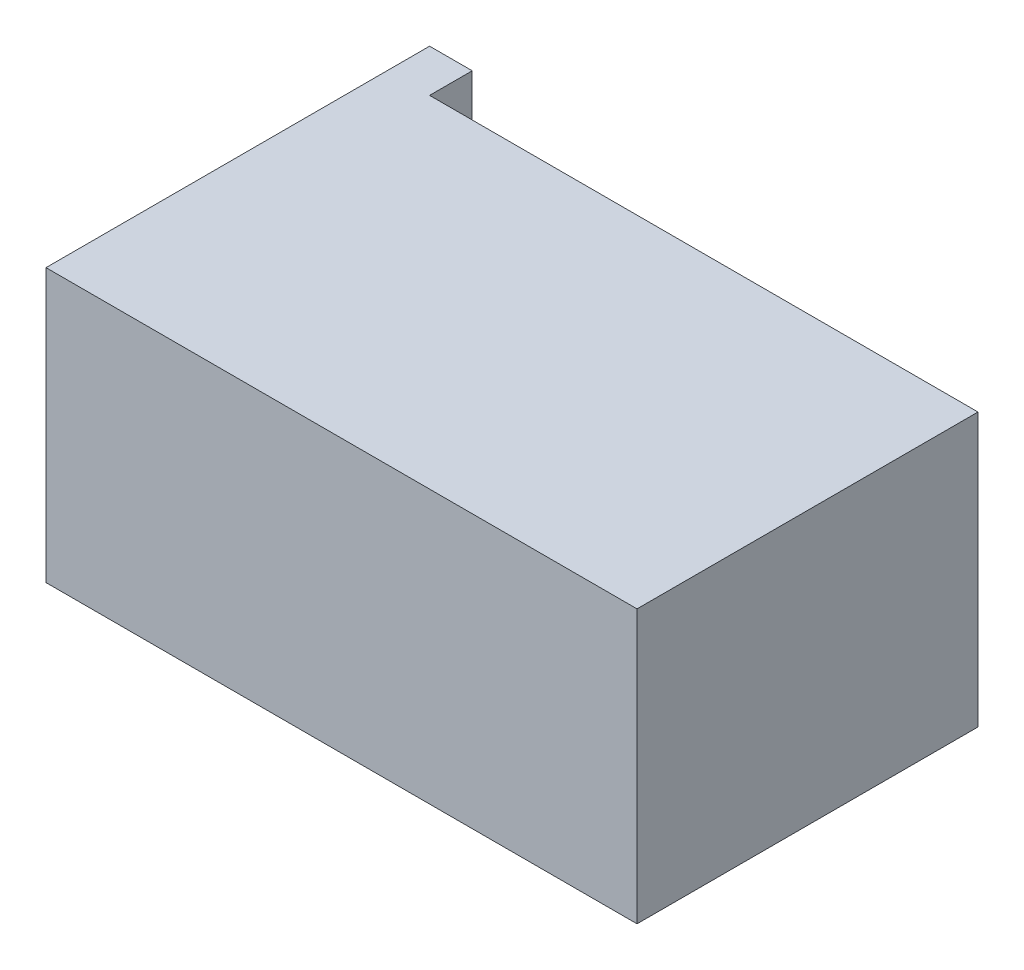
from build123d import *

# Parameters (mm, degrees)
SKETCH1_W           = 52
SKETCH1_H           = 30
BOSS_EXTRUDE1_DEPTH = 24
SKETCH4_W           = 3.75
SKETCH4_H           = 24
BOSS_EXTRUDE2_DEPTH = 3.75


with BuildPart() as part:
    # Sketch1 → Boss-Extrude1 (new body)
    with BuildSketch(Plane(origin=(0, 0, 0), x_dir=(1, 0, 0), z_dir=(0, 1, 0))):
        with Locations((26, 15)):
            Rectangle(SKETCH1_W, SKETCH1_H)
    extrude(amount=BOSS_EXTRUDE1_DEPTH)

    # Sketch4 → Boss-Extrude2 (add)
    with BuildSketch(Plane(origin=(0, 0, -30), x_dir=(-1, 0, 0), z_dir=(0, 0, -1))):
        with Locations((-1.875, 12)):
            Rectangle(SKETCH4_W, SKETCH4_H)
    extrude(amount=BOSS_EXTRUDE2_DEPTH)


solid = part.part
